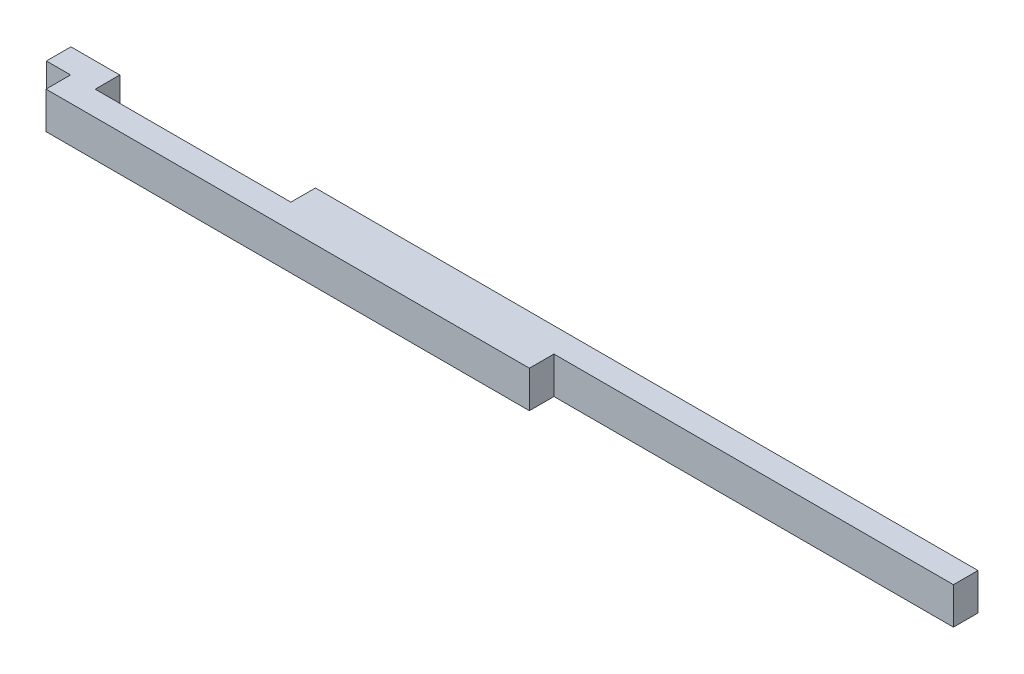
from build123d import *

# Parameters (mm, degrees)
EXTRUDE1_DEPTH = 152.4


with BuildPart() as part:
    # Sketch1 → Extrude1 (new body)
    with BuildSketch(Plane(origin=(0, 0, 0), x_dir=(1, 0, 0), z_dir=(0, 1, 0))):
        Polygon((0, 0), (100, 0), (100, -101.6), (1100, -101.6), (2100, -101.6), (2100, 0), (3752.9406, 0), (3752.9406, 101.6), (1011.56, 101.6), (1011.56, 0), (202, 0), (202, 101.6), (0, 101.6), align=None)
    extrude(amount=EXTRUDE1_DEPTH)


solid = part.part
